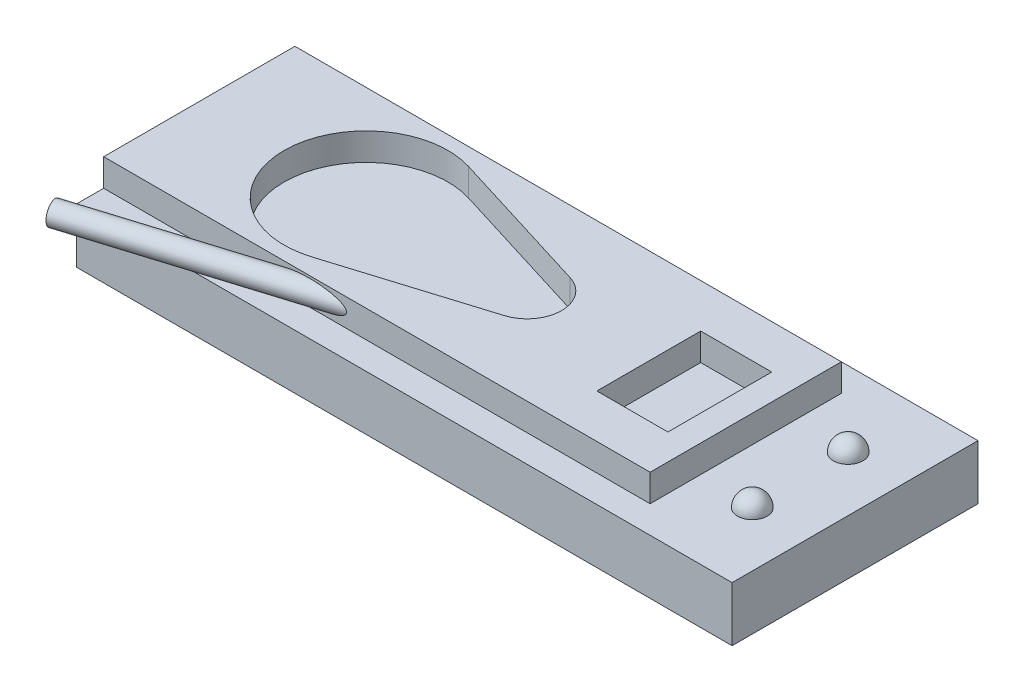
ISO-10303-21;
HEADER;
FILE_DESCRIPTION(('STEP AP214'),'2;1');
FILE_NAME('part.step','',(''),(''),'','','');
FILE_SCHEMA(('AUTOMOTIVE_DESIGN { 1 0 10303 214 1 1 1 1 }'));
ENDSEC;
DATA;
#1=APPLICATION_CONTEXT('core data for automotive mechanical design processes');
#2=APPLICATION_PROTOCOL_DEFINITION('international standard','automotive_design',2000,#1);
#3=PRODUCT_CONTEXT('',#1,'mechanical');
#4=PRODUCT('Part','Part','',(#3));
#5=PRODUCT_RELATED_PRODUCT_CATEGORY('part','',(#4));
#6=PRODUCT_DEFINITION_FORMATION('','',#4);
#7=PRODUCT_DEFINITION_CONTEXT('part definition',#1,'design');
#8=PRODUCT_DEFINITION('design','',#6,#7);
#9=PRODUCT_DEFINITION_SHAPE('','',#8);
#10=(LENGTH_UNIT() NAMED_UNIT(*) SI_UNIT(.MILLI.,.METRE.));
#11=(NAMED_UNIT(*) PLANE_ANGLE_UNIT() SI_UNIT($,.RADIAN.));
#12=(NAMED_UNIT(*) SI_UNIT($,.STERADIAN.) SOLID_ANGLE_UNIT());
#13=UNCERTAINTY_MEASURE_WITH_UNIT(LENGTH_MEASURE(1.E-05),#10,'distance_accuracy_value','');
#14=(GEOMETRIC_REPRESENTATION_CONTEXT(3) GLOBAL_UNCERTAINTY_ASSIGNED_CONTEXT((#13)) GLOBAL_UNIT_ASSIGNED_CONTEXT((#10,
#11,#12)) REPRESENTATION_CONTEXT('',''));
#15=CARTESIAN_POINT('',(0.,0.,0.));
#16=DIRECTION('',(0.,0.,1.));
#17=DIRECTION('',(1.,0.,0.));
#18=AXIS2_PLACEMENT_3D('',#15,#16,#17);
#19=CARTESIAN_POINT('',(0.,10.,0.));
#20=DIRECTION('',(0.,1.,0.));
#21=DIRECTION('',(0.,0.,1.));
#22=AXIS2_PLACEMENT_3D('',#19,#20,#21);
#23=PLANE('',#22);
#24=CARTESIAN_POINT('',(49.9740173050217,10.,8.77273485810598));
#25=DIRECTION('',(0.,1.,0.));
#26=DIRECTION('',(0.,0.,1.));
#27=AXIS2_PLACEMENT_3D('',#24,#25,#26);
#28=CIRCLE('',#27,2.70534052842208);
#29=CARTESIAN_POINT('',(49.9740173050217,10.,11.4780753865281));
#30=VERTEX_POINT('',#29);
#31=EDGE_CURVE('E335',#30,#30,#28,.F.);
#32=ORIENTED_EDGE('',*,*,#31,.T.);
#33=EDGE_LOOP('',(#32));
#34=FACE_BOUND('',#33,.T.);
#35=CARTESIAN_POINT('',(49.9740173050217,10.,-8.77273485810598));
#36=DIRECTION('',(0.,1.,0.));
#37=DIRECTION('',(0.,0.,1.));
#38=AXIS2_PLACEMENT_3D('',#35,#36,#37);
#39=CIRCLE('',#38,2.70534052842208);
#40=CARTESIAN_POINT('',(49.9740173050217,10.,-6.06739432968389));
#41=VERTEX_POINT('',#40);
#42=EDGE_CURVE('E194',#41,#41,#39,.F.);
#43=ORIENTED_EDGE('',*,*,#42,.T.);
#44=EDGE_LOOP('',(#43));
#45=FACE_BOUND('',#44,.T.);
#46=DIRECTION('',(0.,0.,1.));
#47=VECTOR('',#46,1.);
#48=CARTESIAN_POINT('',(-60.,10.,-22.5));
#49=LINE('',#48,#47);
#50=CARTESIAN_POINT('',(-60.,10.,-22.5));
#51=VERTEX_POINT('',#50);
#52=CARTESIAN_POINT('',(-60.,10.,-17.5));
#53=VERTEX_POINT('',#52);
#54=EDGE_CURVE('E301',#51,#53,#49,.T.);
#55=ORIENTED_EDGE('',*,*,#54,.T.);
#56=DIRECTION('',(1.,0.,0.));
#57=VECTOR('',#56,1.);
#58=CARTESIAN_POINT('',(-60.,10.,-17.5));
#59=LINE('',#58,#57);
#60=CARTESIAN_POINT('',(40.,10.,-17.5));
#61=VERTEX_POINT('',#60);
#62=EDGE_CURVE('E242',#53,#61,#59,.T.);
#63=ORIENTED_EDGE('',*,*,#62,.T.);
#64=DIRECTION('',(0.,0.,-1.));
#65=VECTOR('',#64,1.);
#66=CARTESIAN_POINT('',(40.,10.,17.5));
#67=LINE('',#66,#65);
#68=CARTESIAN_POINT('',(40.,10.,17.5));
#69=VERTEX_POINT('',#68);
#70=EDGE_CURVE('E269',#69,#61,#67,.T.);
#71=ORIENTED_EDGE('',*,*,#70,.F.);
#72=DIRECTION('',(1.,0.,0.));
#73=VECTOR('',#72,1.);
#74=CARTESIAN_POINT('',(-60.,10.,17.5));
#75=LINE('',#74,#73);
#76=CARTESIAN_POINT('',(-60.,10.,17.5));
#77=VERTEX_POINT('',#76);
#78=EDGE_CURVE('E256',#77,#69,#75,.T.);
#79=ORIENTED_EDGE('',*,*,#78,.F.);
#80=CARTESIAN_POINT('',(-60.,10.,22.5));
#81=VERTEX_POINT('',#80);
#82=EDGE_CURVE('E300',#77,#81,#49,.T.);
#83=ORIENTED_EDGE('',*,*,#82,.T.);
#84=DIRECTION('',(1.,0.,0.));
#85=VECTOR('',#84,1.);
#86=CARTESIAN_POINT('',(-60.,10.,22.5));
#87=LINE('',#86,#85);
#88=CARTESIAN_POINT('',(60.,10.,22.5));
#89=VERTEX_POINT('',#88);
#90=EDGE_CURVE('E304',#81,#89,#87,.T.);
#91=ORIENTED_EDGE('',*,*,#90,.T.);
#92=DIRECTION('',(0.,0.,-1.));
#93=VECTOR('',#92,1.);
#94=CARTESIAN_POINT('',(60.,10.,-22.5));
#95=LINE('',#94,#93);
#96=CARTESIAN_POINT('',(60.,10.,-22.5));
#97=VERTEX_POINT('',#96);
#98=EDGE_CURVE('E292',#89,#97,#95,.T.);
#99=ORIENTED_EDGE('',*,*,#98,.T.);
#100=DIRECTION('',(-1.,0.,0.));
#101=VECTOR('',#100,1.);
#102=CARTESIAN_POINT('',(-60.,10.,-22.5));
#103=LINE('',#102,#101);
#104=EDGE_CURVE('E296',#97,#51,#103,.T.);
#105=ORIENTED_EDGE('',*,*,#104,.T.);
#106=EDGE_LOOP('',(#55,#63,#71,#79,#83,#91,#99,#105));
#107=FACE_BOUND('',#106,.T.);
#108=ADVANCED_FACE('F41',(#34,#45,#107),#23,.T.);
#109=CARTESIAN_POINT('',(60.,10.,-22.5));
#110=DIRECTION('',(-1.,0.,0.));
#111=DIRECTION('',(0.,0.,1.));
#112=AXIS2_PLACEMENT_3D('',#109,#110,#111);
#113=PLANE('',#112);
#114=DIRECTION('',(0.,0.,-1.));
#115=VECTOR('',#114,1.);
#116=CARTESIAN_POINT('',(60.,0.,-22.5));
#117=LINE('',#116,#115);
#118=CARTESIAN_POINT('',(60.,0.,22.5));
#119=VERTEX_POINT('',#118);
#120=CARTESIAN_POINT('',(60.,0.,-22.5));
#121=VERTEX_POINT('',#120);
#122=EDGE_CURVE('E280',#119,#121,#117,.T.);
#123=ORIENTED_EDGE('',*,*,#122,.T.);
#124=DIRECTION('',(0.,-1.,0.));
#125=VECTOR('',#124,1.);
#126=CARTESIAN_POINT('',(60.,10.,-22.5));
#127=LINE('',#126,#125);
#128=EDGE_CURVE('E50',#97,#121,#127,.T.);
#129=ORIENTED_EDGE('',*,*,#128,.F.);
#130=ORIENTED_EDGE('',*,*,#98,.F.);
#131=DIRECTION('',(0.,-1.,0.));
#132=VECTOR('',#131,1.);
#133=CARTESIAN_POINT('',(60.,10.,22.5));
#134=LINE('',#133,#132);
#135=EDGE_CURVE('E307',#89,#119,#134,.T.);
#136=ORIENTED_EDGE('',*,*,#135,.T.);
#137=EDGE_LOOP('',(#123,#129,#130,#136));
#138=FACE_BOUND('',#137,.T.);
#139=ADVANCED_FACE('F43',(#138),#113,.F.);
#140=CARTESIAN_POINT('',(-60.,10.,-22.5));
#141=DIRECTION('',(0.,0.,1.));
#142=DIRECTION('',(1.,0.,0.));
#143=AXIS2_PLACEMENT_3D('',#140,#141,#142);
#144=PLANE('',#143);
#145=DIRECTION('',(-1.,0.,0.));
#146=VECTOR('',#145,1.);
#147=CARTESIAN_POINT('',(-60.,0.,-22.5));
#148=LINE('',#147,#146);
#149=CARTESIAN_POINT('',(-60.,0.,-22.5));
#150=VERTEX_POINT('',#149);
#151=EDGE_CURVE('E311',#121,#150,#148,.T.);
#152=ORIENTED_EDGE('',*,*,#151,.T.);
#153=DIRECTION('',(0.,-1.,0.));
#154=VECTOR('',#153,1.);
#155=CARTESIAN_POINT('',(-60.,10.,-22.5));
#156=LINE('',#155,#154);
#157=EDGE_CURVE('E326',#51,#150,#156,.T.);
#158=ORIENTED_EDGE('',*,*,#157,.F.);
#159=ORIENTED_EDGE('',*,*,#104,.F.);
#160=ORIENTED_EDGE('',*,*,#128,.T.);
#161=EDGE_LOOP('',(#152,#158,#159,#160));
#162=FACE_BOUND('',#161,.T.);
#163=ADVANCED_FACE('F386',(#162),#144,.F.);
#164=CARTESIAN_POINT('',(-60.,10.,-22.5));
#165=DIRECTION('',(1.,0.,0.));
#166=DIRECTION('',(0.,0.,-1.));
#167=AXIS2_PLACEMENT_3D('',#164,#165,#166);
#168=PLANE('',#167);
#169=DIRECTION('',(0.,0.,1.));
#170=VECTOR('',#169,1.);
#171=CARTESIAN_POINT('',(-60.,0.,-22.5));
#172=LINE('',#171,#170);
#173=CARTESIAN_POINT('',(-60.,0.,22.5));
#174=VERTEX_POINT('',#173);
#175=EDGE_CURVE('E314',#150,#174,#172,.T.);
#176=ORIENTED_EDGE('',*,*,#175,.T.);
#177=DIRECTION('',(0.,-1.,0.));
#178=VECTOR('',#177,1.);
#179=CARTESIAN_POINT('',(-60.,10.,22.5));
#180=LINE('',#179,#178);
#181=EDGE_CURVE('E322',#81,#174,#180,.T.);
#182=ORIENTED_EDGE('',*,*,#181,.F.);
#183=ORIENTED_EDGE('',*,*,#82,.F.);
#184=DIRECTION('',(0.,-1.,0.));
#185=VECTOR('',#184,1.);
#186=CARTESIAN_POINT('',(-60.,15.,17.5));
#187=LINE('',#186,#185);
#188=CARTESIAN_POINT('',(-60.,15.,17.5));
#189=VERTEX_POINT('',#188);
#190=EDGE_CURVE('E276',#189,#77,#187,.T.);
#191=ORIENTED_EDGE('',*,*,#190,.F.);
#192=DIRECTION('',(0.,0.,-1.));
#193=VECTOR('',#192,1.);
#194=CARTESIAN_POINT('',(-60.,15.,17.5));
#195=LINE('',#194,#193);
#196=CARTESIAN_POINT('',(-60.,15.,-17.5));
#197=VERTEX_POINT('',#196);
#198=EDGE_CURVE('E251',#189,#197,#195,.T.);
#199=ORIENTED_EDGE('',*,*,#198,.T.);
#200=DIRECTION('',(0.,-1.,0.));
#201=VECTOR('',#200,1.);
#202=CARTESIAN_POINT('',(-60.,15.,-17.5));
#203=LINE('',#202,#201);
#204=EDGE_CURVE('E266',#197,#53,#203,.T.);
#205=ORIENTED_EDGE('',*,*,#204,.T.);
#206=ORIENTED_EDGE('',*,*,#54,.F.);
#207=ORIENTED_EDGE('',*,*,#157,.T.);
#208=EDGE_LOOP('',(#176,#182,#183,#191,#199,#205,#206,#207));
#209=FACE_BOUND('',#208,.T.);
#210=ADVANCED_FACE('F371',(#209),#168,.F.);
#211=CARTESIAN_POINT('',(-60.,10.,22.5));
#212=DIRECTION('',(0.,0.,-1.));
#213=DIRECTION('',(-1.,0.,0.));
#214=AXIS2_PLACEMENT_3D('',#211,#212,#213);
#215=PLANE('',#214);
#216=DIRECTION('',(1.,0.,0.));
#217=VECTOR('',#216,1.);
#218=CARTESIAN_POINT('',(-60.,0.,22.5));
#219=LINE('',#218,#217);
#220=EDGE_CURVE('E297',#174,#119,#219,.T.);
#221=ORIENTED_EDGE('',*,*,#220,.T.);
#222=ORIENTED_EDGE('',*,*,#135,.F.);
#223=ORIENTED_EDGE('',*,*,#90,.F.);
#224=ORIENTED_EDGE('',*,*,#181,.T.);
#225=EDGE_LOOP('',(#221,#222,#223,#224));
#226=FACE_BOUND('',#225,.T.);
#227=ADVANCED_FACE('F381',(#226),#215,.F.);
#228=CARTESIAN_POINT('',(0.,0.,0.));
#229=DIRECTION('',(0.,1.,0.));
#230=DIRECTION('',(0.,0.,1.));
#231=AXIS2_PLACEMENT_3D('',#228,#229,#230);
#232=PLANE('',#231);
#233=ORIENTED_EDGE('',*,*,#122,.F.);
#234=ORIENTED_EDGE('',*,*,#220,.F.);
#235=ORIENTED_EDGE('',*,*,#175,.F.);
#236=ORIENTED_EDGE('',*,*,#151,.F.);
#237=EDGE_LOOP('',(#233,#234,#235,#236));
#238=FACE_BOUND('',#237,.T.);
#239=ADVANCED_FACE('F357',(#238),#232,.F.);
#240=CARTESIAN_POINT('',(-60.,15.,17.5));
#241=DIRECTION('',(0.,0.,-1.));
#242=DIRECTION('',(-1.,0.,0.));
#243=AXIS2_PLACEMENT_3D('',#240,#241,#242);
#244=PLANE('',#243);
#245=CARTESIAN_POINT('',(-22.3274598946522,12.5778105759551,17.5));
#246=DIRECTION('',(0.,0.,-1.));
#247=DIRECTION('',(1.,0.,0.));
#248=AXIS2_PLACEMENT_3D('',#245,#246,#247);
#249=ELLIPSE('',#248,6.77349939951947,2.);
#250=CARTESIAN_POINT('',(-15.5539604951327,12.5778105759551,17.5));
#251=VERTEX_POINT('',#250);
#252=EDGE_CURVE('E11',#251,#251,#249,.F.);
#253=ORIENTED_EDGE('',*,*,#252,.F.);
#254=EDGE_LOOP('',(#253));
#255=FACE_BOUND('',#254,.T.);
#256=ORIENTED_EDGE('',*,*,#78,.T.);
#257=DIRECTION('',(0.,-1.,0.));
#258=VECTOR('',#257,1.);
#259=CARTESIAN_POINT('',(40.,15.,17.5));
#260=LINE('',#259,#258);
#261=CARTESIAN_POINT('',(40.,15.,17.5));
#262=VERTEX_POINT('',#261);
#263=EDGE_CURVE('E281',#262,#69,#260,.T.);
#264=ORIENTED_EDGE('',*,*,#263,.F.);
#265=DIRECTION('',(1.,0.,0.));
#266=VECTOR('',#265,1.);
#267=CARTESIAN_POINT('',(-60.,15.,17.5));
#268=LINE('',#267,#266);
#269=EDGE_CURVE('E263',#189,#262,#268,.T.);
#270=ORIENTED_EDGE('',*,*,#269,.F.);
#271=ORIENTED_EDGE('',*,*,#190,.T.);
#272=EDGE_LOOP('',(#256,#264,#270,#271));
#273=FACE_BOUND('',#272,.T.);
#274=ADVANCED_FACE('F353',(#255,#273),#244,.F.);
#275=CARTESIAN_POINT('',(40.,15.,17.5));
#276=DIRECTION('',(-1.,0.,0.));
#277=DIRECTION('',(0.,0.,1.));
#278=AXIS2_PLACEMENT_3D('',#275,#276,#277);
#279=PLANE('',#278);
#280=ORIENTED_EDGE('',*,*,#70,.T.);
#281=DIRECTION('',(0.,-1.,0.));
#282=VECTOR('',#281,1.);
#283=CARTESIAN_POINT('',(40.,15.,-17.5));
#284=LINE('',#283,#282);
#285=CARTESIAN_POINT('',(40.,15.,-17.5));
#286=VERTEX_POINT('',#285);
#287=EDGE_CURVE('E285',#286,#61,#284,.T.);
#288=ORIENTED_EDGE('',*,*,#287,.F.);
#289=DIRECTION('',(0.,0.,-1.));
#290=VECTOR('',#289,1.);
#291=CARTESIAN_POINT('',(40.,15.,17.5));
#292=LINE('',#291,#290);
#293=EDGE_CURVE('E260',#262,#286,#292,.T.);
#294=ORIENTED_EDGE('',*,*,#293,.F.);
#295=ORIENTED_EDGE('',*,*,#263,.T.);
#296=EDGE_LOOP('',(#280,#288,#294,#295));
#297=FACE_BOUND('',#296,.T.);
#298=ADVANCED_FACE('F356',(#297),#279,.F.);
#299=CARTESIAN_POINT('',(-60.,15.,-17.5));
#300=DIRECTION('',(0.,0.,-1.));
#301=DIRECTION('',(-1.,0.,0.));
#302=AXIS2_PLACEMENT_3D('',#299,#300,#301);
#303=PLANE('',#302);
#304=ORIENTED_EDGE('',*,*,#62,.F.);
#305=ORIENTED_EDGE('',*,*,#204,.F.);
#306=DIRECTION('',(1.,0.,0.));
#307=VECTOR('',#306,1.);
#308=CARTESIAN_POINT('',(-60.,15.,-17.5));
#309=LINE('',#308,#307);
#310=EDGE_CURVE('E255',#197,#286,#309,.T.);
#311=ORIENTED_EDGE('',*,*,#310,.T.);
#312=ORIENTED_EDGE('',*,*,#287,.T.);
#313=EDGE_LOOP('',(#304,#305,#311,#312));
#314=FACE_BOUND('',#313,.T.);
#315=ADVANCED_FACE('F403',(#314),#303,.T.);
#316=CARTESIAN_POINT('',(0.,15.,0.));
#317=DIRECTION('',(0.,-1.,0.));
#318=DIRECTION('',(0.,0.,-1.));
#319=AXIS2_PLACEMENT_3D('',#316,#317,#318);
#320=PLANE('',#319);
#321=DIRECTION('',(-1.,0.,0.));
#322=VECTOR('',#321,1.);
#323=CARTESIAN_POINT('',(22.2556339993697,15.,-9.5));
#324=LINE('',#323,#322);
#325=CARTESIAN_POINT('',(35.2556339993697,15.,-9.5));
#326=VERTEX_POINT('',#325);
#327=CARTESIAN_POINT('',(22.2556339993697,15.,-9.5));
#328=VERTEX_POINT('',#327);
#329=EDGE_CURVE('E193',#326,#328,#324,.T.);
#330=ORIENTED_EDGE('',*,*,#329,.F.);
#331=DIRECTION('',(0.,0.,-1.));
#332=VECTOR('',#331,1.);
#333=CARTESIAN_POINT('',(35.2556339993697,15.,9.5));
#334=LINE('',#333,#332);
#335=CARTESIAN_POINT('',(35.2556339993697,15.,9.5));
#336=VERTEX_POINT('',#335);
#337=EDGE_CURVE('E57',#336,#326,#334,.T.);
#338=ORIENTED_EDGE('',*,*,#337,.F.);
#339=DIRECTION('',(1.,0.,0.));
#340=VECTOR('',#339,1.);
#341=CARTESIAN_POINT('',(22.2556339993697,15.,9.5));
#342=LINE('',#341,#340);
#343=CARTESIAN_POINT('',(22.2556339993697,15.,9.5));
#344=VERTEX_POINT('',#343);
#345=EDGE_CURVE('E178',#344,#336,#342,.T.);
#346=ORIENTED_EDGE('',*,*,#345,.F.);
#347=DIRECTION('',(0.,0.,1.));
#348=VECTOR('',#347,1.);
#349=CARTESIAN_POINT('',(22.2556339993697,15.,9.5));
#350=LINE('',#349,#348);
#351=EDGE_CURVE('E182',#328,#344,#350,.T.);
#352=ORIENTED_EDGE('',*,*,#351,.F.);
#353=EDGE_LOOP('',(#330,#338,#346,#352));
#354=FACE_BOUND('',#353,.T.);
#355=DIRECTION('',(-0.955414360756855,0.,-0.295268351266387));
#356=VECTOR('',#355,1.);
#357=CARTESIAN_POINT('',(1.85853636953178,15.,-6.01375775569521));
#358=LINE('',#357,#356);
#359=CARTESIAN_POINT('',(1.85853636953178,15.,-6.01375775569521));
#360=VERTEX_POINT('',#359);
#361=CARTESIAN_POINT('',(-25.0546714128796,15.,-14.3312154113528));
#362=VERTEX_POINT('',#361);
#363=EDGE_CURVE('E228',#360,#362,#358,.T.);
#364=ORIENTED_EDGE('',*,*,#363,.F.);
#365=CARTESIAN_POINT('',(0.,15.,0.));
#366=DIRECTION('',(0.,1.,0.));
#367=DIRECTION('',(0.,0.,1.));
#368=AXIS2_PLACEMENT_3D('',#365,#366,#367);
#369=CIRCLE('',#368,6.29439749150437);
#370=CARTESIAN_POINT('',(1.8585363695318,15.,6.01375775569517));
#371=VERTEX_POINT('',#370);
#372=EDGE_CURVE('E65',#371,#360,#369,.T.);
#373=ORIENTED_EDGE('',*,*,#372,.F.);
#374=DIRECTION('',(0.955414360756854,0.,-0.29526835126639));
#375=VECTOR('',#374,1.);
#376=CARTESIAN_POINT('',(1.8585363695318,15.,6.01375775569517));
#377=LINE('',#376,#375);
#378=CARTESIAN_POINT('',(-25.0546714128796,15.,14.3312154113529));
#379=VERTEX_POINT('',#378);
#380=EDGE_CURVE('E213',#379,#371,#377,.T.);
#381=ORIENTED_EDGE('',*,*,#380,.F.);
#382=CARTESIAN_POINT('',(-29.4836966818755,15.,0.));
#383=DIRECTION('',(0.,1.,0.));
#384=DIRECTION('',(0.,0.,1.));
#385=AXIS2_PLACEMENT_3D('',#382,#383,#384);
#386=CIRCLE('',#385,15.);
#387=EDGE_CURVE('E232',#362,#379,#386,.T.);
#388=ORIENTED_EDGE('',*,*,#387,.F.);
#389=EDGE_LOOP('',(#364,#373,#381,#388));
#390=FACE_BOUND('',#389,.T.);
#391=ORIENTED_EDGE('',*,*,#198,.F.);
#392=ORIENTED_EDGE('',*,*,#269,.T.);
#393=ORIENTED_EDGE('',*,*,#293,.T.);
#394=ORIENTED_EDGE('',*,*,#310,.F.);
#395=EDGE_LOOP('',(#391,#392,#393,#394));
#396=FACE_BOUND('',#395,.T.);
#397=ADVANCED_FACE('F369',(#354,#390,#396),#320,.F.);
#398=CARTESIAN_POINT('',(0.,10.,0.));
#399=DIRECTION('',(0.,1.,0.));
#400=DIRECTION('',(0.,0.,1.));
#401=AXIS2_PLACEMENT_3D('',#398,#399,#400);
#402=CYLINDRICAL_SURFACE('',#401,6.29439749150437);
#403=ORIENTED_EDGE('',*,*,#372,.T.);
#404=DIRECTION('',(0.,1.,0.));
#405=VECTOR('',#404,1.);
#406=CARTESIAN_POINT('',(1.85853636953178,10.,-6.01375775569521));
#407=LINE('',#406,#405);
#408=CARTESIAN_POINT('',(1.85853636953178,10.,-6.01375775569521));
#409=VERTEX_POINT('',#408);
#410=EDGE_CURVE('E225',#409,#360,#407,.T.);
#411=ORIENTED_EDGE('',*,*,#410,.F.);
#412=CARTESIAN_POINT('',(0.,10.,0.));
#413=DIRECTION('',(0.,1.,0.));
#414=DIRECTION('',(0.,0.,1.));
#415=AXIS2_PLACEMENT_3D('',#412,#413,#414);
#416=CIRCLE('',#415,6.29439749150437);
#417=CARTESIAN_POINT('',(1.8585363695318,10.,6.01375775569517));
#418=VERTEX_POINT('',#417);
#419=EDGE_CURVE('E208',#418,#409,#416,.T.);
#420=ORIENTED_EDGE('',*,*,#419,.F.);
#421=DIRECTION('',(0.,1.,0.));
#422=VECTOR('',#421,1.);
#423=CARTESIAN_POINT('',(1.8585363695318,10.,6.01375775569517));
#424=LINE('',#423,#422);
#425=EDGE_CURVE('E239',#418,#371,#424,.T.);
#426=ORIENTED_EDGE('',*,*,#425,.T.);
#427=EDGE_LOOP('',(#403,#411,#420,#426));
#428=FACE_BOUND('',#427,.T.);
#429=ADVANCED_FACE('F411',(#428),#402,.F.);
#430=CARTESIAN_POINT('',(1.8585363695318,10.,6.01375775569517));
#431=DIRECTION('',(0.29526835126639,0.,0.955414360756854));
#432=DIRECTION('',(0.955414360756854,0.,-0.29526835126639));
#433=AXIS2_PLACEMENT_3D('',#430,#431,#432);
#434=PLANE('',#433);
#435=ORIENTED_EDGE('',*,*,#380,.T.);
#436=ORIENTED_EDGE('',*,*,#425,.F.);
#437=DIRECTION('',(0.955414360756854,0.,-0.29526835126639));
#438=VECTOR('',#437,1.);
#439=CARTESIAN_POINT('',(1.8585363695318,10.,6.01375775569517));
#440=LINE('',#439,#438);
#441=CARTESIAN_POINT('',(-25.0546714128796,10.,14.3312154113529));
#442=VERTEX_POINT('',#441);
#443=EDGE_CURVE('E221',#442,#418,#440,.T.);
#444=ORIENTED_EDGE('',*,*,#443,.F.);
#445=DIRECTION('',(0.,1.,0.));
#446=VECTOR('',#445,1.);
#447=CARTESIAN_POINT('',(-25.0546714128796,10.,14.3312154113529));
#448=LINE('',#447,#446);
#449=EDGE_CURVE('E243',#442,#379,#448,.T.);
#450=ORIENTED_EDGE('',*,*,#449,.T.);
#451=EDGE_LOOP('',(#435,#436,#444,#450));
#452=FACE_BOUND('',#451,.T.);
#453=ADVANCED_FACE('F415',(#452),#434,.F.);
#454=CARTESIAN_POINT('',(-29.4836966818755,10.,0.));
#455=DIRECTION('',(0.,1.,0.));
#456=DIRECTION('',(0.,0.,1.));
#457=AXIS2_PLACEMENT_3D('',#454,#455,#456);
#458=CYLINDRICAL_SURFACE('',#457,15.);
#459=ORIENTED_EDGE('',*,*,#387,.T.);
#460=ORIENTED_EDGE('',*,*,#449,.F.);
#461=CARTESIAN_POINT('',(-29.4836966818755,10.,0.));
#462=DIRECTION('',(0.,1.,0.));
#463=DIRECTION('',(0.,0.,1.));
#464=AXIS2_PLACEMENT_3D('',#461,#462,#463);
#465=CIRCLE('',#464,15.);
#466=CARTESIAN_POINT('',(-25.0546714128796,10.,-14.3312154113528));
#467=VERTEX_POINT('',#466);
#468=EDGE_CURVE('E217',#467,#442,#465,.T.);
#469=ORIENTED_EDGE('',*,*,#468,.F.);
#470=DIRECTION('',(0.,1.,0.));
#471=VECTOR('',#470,1.);
#472=CARTESIAN_POINT('',(-25.0546714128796,10.,-14.3312154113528));
#473=LINE('',#472,#471);
#474=EDGE_CURVE('E246',#467,#362,#473,.T.);
#475=ORIENTED_EDGE('',*,*,#474,.T.);
#476=EDGE_LOOP('',(#459,#460,#469,#475));
#477=FACE_BOUND('',#476,.T.);
#478=ADVANCED_FACE('F420',(#477),#458,.F.);
#479=CARTESIAN_POINT('',(1.85853636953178,10.,-6.01375775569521));
#480=DIRECTION('',(0.295268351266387,0.,-0.955414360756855));
#481=DIRECTION('',(-0.955414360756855,0.,-0.295268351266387));
#482=AXIS2_PLACEMENT_3D('',#479,#480,#481);
#483=PLANE('',#482);
#484=ORIENTED_EDGE('',*,*,#363,.T.);
#485=ORIENTED_EDGE('',*,*,#474,.F.);
#486=DIRECTION('',(-0.955414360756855,0.,-0.295268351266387));
#487=VECTOR('',#486,1.);
#488=CARTESIAN_POINT('',(1.85853636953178,10.,-6.01375775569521));
#489=LINE('',#488,#487);
#490=EDGE_CURVE('E212',#409,#467,#489,.T.);
#491=ORIENTED_EDGE('',*,*,#490,.F.);
#492=ORIENTED_EDGE('',*,*,#410,.T.);
#493=EDGE_LOOP('',(#484,#485,#491,#492));
#494=FACE_BOUND('',#493,.T.);
#495=ADVANCED_FACE('F416',(#494),#483,.F.);
#496=CARTESIAN_POINT('',(0.,10.,0.));
#497=DIRECTION('',(0.,1.,0.));
#498=DIRECTION('',(0.,0.,1.));
#499=AXIS2_PLACEMENT_3D('',#496,#497,#498);
#500=PLANE('',#499);
#501=ORIENTED_EDGE('',*,*,#419,.T.);
#502=ORIENTED_EDGE('',*,*,#490,.T.);
#503=ORIENTED_EDGE('',*,*,#468,.T.);
#504=ORIENTED_EDGE('',*,*,#443,.T.);
#505=EDGE_LOOP('',(#501,#502,#503,#504));
#506=FACE_BOUND('',#505,.T.);
#507=ADVANCED_FACE('F419',(#506),#500,.T.);
#508=CARTESIAN_POINT('',(35.2556339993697,10.,9.5));
#509=DIRECTION('',(1.,0.,0.));
#510=DIRECTION('',(0.,0.,-1.));
#511=AXIS2_PLACEMENT_3D('',#508,#509,#510);
#512=PLANE('',#511);
#513=ORIENTED_EDGE('',*,*,#337,.T.);
#514=DIRECTION('',(0.,1.,0.));
#515=VECTOR('',#514,1.);
#516=CARTESIAN_POINT('',(35.2556339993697,10.,-9.5));
#517=LINE('',#516,#515);
#518=CARTESIAN_POINT('',(35.2556339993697,10.,-9.5));
#519=VERTEX_POINT('',#518);
#520=EDGE_CURVE('E153',#519,#326,#517,.T.);
#521=ORIENTED_EDGE('',*,*,#520,.F.);
#522=DIRECTION('',(0.,0.,-1.));
#523=VECTOR('',#522,1.);
#524=CARTESIAN_POINT('',(35.2556339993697,10.,9.5));
#525=LINE('',#524,#523);
#526=CARTESIAN_POINT('',(35.2556339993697,10.,9.5));
#527=VERTEX_POINT('',#526);
#528=EDGE_CURVE('E157',#527,#519,#525,.T.);
#529=ORIENTED_EDGE('',*,*,#528,.F.);
#530=DIRECTION('',(0.,1.,0.));
#531=VECTOR('',#530,1.);
#532=CARTESIAN_POINT('',(35.2556339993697,10.,9.5));
#533=LINE('',#532,#531);
#534=EDGE_CURVE('E200',#527,#336,#533,.T.);
#535=ORIENTED_EDGE('',*,*,#534,.T.);
#536=EDGE_LOOP('',(#513,#521,#529,#535));
#537=FACE_BOUND('',#536,.T.);
#538=ADVANCED_FACE('F155',(#537),#512,.F.);
#539=CARTESIAN_POINT('',(22.2556339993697,10.,9.5));
#540=DIRECTION('',(0.,0.,1.));
#541=DIRECTION('',(1.,0.,0.));
#542=AXIS2_PLACEMENT_3D('',#539,#540,#541);
#543=PLANE('',#542);
#544=ORIENTED_EDGE('',*,*,#345,.T.);
#545=ORIENTED_EDGE('',*,*,#534,.F.);
#546=DIRECTION('',(1.,0.,0.));
#547=VECTOR('',#546,1.);
#548=CARTESIAN_POINT('',(22.2556339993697,10.,9.5));
#549=LINE('',#548,#547);
#550=CARTESIAN_POINT('',(22.2556339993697,10.,9.5));
#551=VERTEX_POINT('',#550);
#552=EDGE_CURVE('E164',#551,#527,#549,.T.);
#553=ORIENTED_EDGE('',*,*,#552,.F.);
#554=DIRECTION('',(0.,1.,0.));
#555=VECTOR('',#554,1.);
#556=CARTESIAN_POINT('',(22.2556339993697,10.,9.5));
#557=LINE('',#556,#555);
#558=EDGE_CURVE('E203',#551,#344,#557,.T.);
#559=ORIENTED_EDGE('',*,*,#558,.T.);
#560=EDGE_LOOP('',(#544,#545,#553,#559));
#561=FACE_BOUND('',#560,.T.);
#562=ADVANCED_FACE('F433',(#561),#543,.F.);
#563=CARTESIAN_POINT('',(22.2556339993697,10.,9.5));
#564=DIRECTION('',(-1.,0.,0.));
#565=DIRECTION('',(0.,0.,1.));
#566=AXIS2_PLACEMENT_3D('',#563,#564,#565);
#567=PLANE('',#566);
#568=ORIENTED_EDGE('',*,*,#351,.T.);
#569=ORIENTED_EDGE('',*,*,#558,.F.);
#570=DIRECTION('',(0.,0.,1.));
#571=VECTOR('',#570,1.);
#572=CARTESIAN_POINT('',(22.2556339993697,10.,9.5));
#573=LINE('',#572,#571);
#574=CARTESIAN_POINT('',(22.2556339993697,10.,-9.5));
#575=VERTEX_POINT('',#574);
#576=EDGE_CURVE('E173',#575,#551,#573,.T.);
#577=ORIENTED_EDGE('',*,*,#576,.F.);
#578=DIRECTION('',(0.,1.,0.));
#579=VECTOR('',#578,1.);
#580=CARTESIAN_POINT('',(22.2556339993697,10.,-9.5));
#581=LINE('',#580,#579);
#582=EDGE_CURVE('E163',#575,#328,#581,.T.);
#583=ORIENTED_EDGE('',*,*,#582,.T.);
#584=EDGE_LOOP('',(#568,#569,#577,#583));
#585=FACE_BOUND('',#584,.T.);
#586=ADVANCED_FACE('F436',(#585),#567,.F.);
#587=CARTESIAN_POINT('',(22.2556339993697,10.,-9.5));
#588=DIRECTION('',(0.,0.,-1.));
#589=DIRECTION('',(-1.,0.,0.));
#590=AXIS2_PLACEMENT_3D('',#587,#588,#589);
#591=PLANE('',#590);
#592=ORIENTED_EDGE('',*,*,#329,.T.);
#593=ORIENTED_EDGE('',*,*,#582,.F.);
#594=DIRECTION('',(-1.,0.,0.));
#595=VECTOR('',#594,1.);
#596=CARTESIAN_POINT('',(22.2556339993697,10.,-9.5));
#597=LINE('',#596,#595);
#598=EDGE_CURVE('E167',#519,#575,#597,.T.);
#599=ORIENTED_EDGE('',*,*,#598,.F.);
#600=ORIENTED_EDGE('',*,*,#520,.T.);
#601=EDGE_LOOP('',(#592,#593,#599,#600));
#602=FACE_BOUND('',#601,.T.);
#603=ADVANCED_FACE('F168',(#602),#591,.F.);
#604=CARTESIAN_POINT('',(0.,10.,0.));
#605=DIRECTION('',(0.,-1.,0.));
#606=DIRECTION('',(0.,0.,-1.));
#607=AXIS2_PLACEMENT_3D('',#604,#605,#606);
#608=PLANE('',#607);
#609=ORIENTED_EDGE('',*,*,#528,.T.);
#610=ORIENTED_EDGE('',*,*,#598,.T.);
#611=ORIENTED_EDGE('',*,*,#576,.T.);
#612=ORIENTED_EDGE('',*,*,#552,.T.);
#613=EDGE_LOOP('',(#609,#610,#611,#612));
#614=FACE_BOUND('',#613,.T.);
#615=ADVANCED_FACE('F175',(#614),#608,.F.);
#616=CARTESIAN_POINT('',(49.9740173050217,10.,-8.77273485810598));
#617=DIRECTION('',(-1.,0.,0.));
#618=DIRECTION('',(0.,0.,1.));
#619=AXIS2_PLACEMENT_3D('',#616,#617,#618);
#620=SPHERICAL_SURFACE('',#619,2.70534052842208);
#621=CARTESIAN_POINT('',(49.9740173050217,10.,-8.77273485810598));
#622=DIRECTION('',(0.,1.,0.));
#623=DIRECTION('',(0.,0.,1.));
#624=AXIS2_PLACEMENT_3D('',#621,#622,#623);
#625=SPHERICAL_SURFACE('',#624,2.70534052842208);
#626=ORIENTED_EDGE('',*,*,#42,.F.);
#627=EDGE_LOOP('',(#626));
#628=FACE_BOUND('',#627,.T.);
#629=ADVANCED_FACE('F445',(#628),#625,.T.);
#630=CARTESIAN_POINT('',(49.9740173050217,10.,8.77273485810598));
#631=DIRECTION('',(-1.,0.,0.));
#632=DIRECTION('',(0.,0.,-1.));
#633=AXIS2_PLACEMENT_3D('',#630,#631,#632);
#634=SPHERICAL_SURFACE('',#633,2.70534052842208);
#635=CARTESIAN_POINT('',(49.9740173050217,10.,8.77273485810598));
#636=DIRECTION('',(0.,1.,0.));
#637=DIRECTION('',(0.,0.,1.));
#638=AXIS2_PLACEMENT_3D('',#635,#636,#637);
#639=SPHERICAL_SURFACE('',#638,2.70534052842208);
#640=ORIENTED_EDGE('',*,*,#31,.F.);
#641=EDGE_LOOP('',(#640));
#642=FACE_BOUND('',#641,.T.);
#643=ADVANCED_FACE('F349',(#642),#639,.T.);
#644=CARTESIAN_POINT('',(-58.1562895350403,12.5778105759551,28.5728076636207));
#645=DIRECTION('',(0.955414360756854,0.,-0.29526835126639));
#646=DIRECTION('',(-0.29526835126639,0.,-0.955414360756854));
#647=AXIS2_PLACEMENT_3D('',#644,#645,#646);
#648=CYLINDRICAL_SURFACE('',#647,2.);
#649=CARTESIAN_POINT('',(-58.1562895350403,12.5778105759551,28.5728076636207));
#650=DIRECTION('',(-0.955414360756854,0.,0.29526835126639));
#651=DIRECTION('',(0.29526835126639,0.,0.955414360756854));
#652=AXIS2_PLACEMENT_3D('',#649,#650,#651);
#653=CIRCLE('',#652,2.);
#654=CARTESIAN_POINT('',(-57.5657528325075,12.5778105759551,30.4836363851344));
#655=VERTEX_POINT('',#654);
#656=EDGE_CURVE('E185',#655,#655,#653,.T.);
#657=ORIENTED_EDGE('',*,*,#656,.F.);
#658=EDGE_LOOP('',(#657));
#659=FACE_BOUND('',#658,.T.);
#660=ORIENTED_EDGE('',*,*,#252,.T.);
#661=EDGE_LOOP('',(#660));
#662=FACE_BOUND('',#661,.T.);
#663=ADVANCED_FACE('F346',(#659,#662),#648,.T.);
#664=CARTESIAN_POINT('',(-58.1562895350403,12.5778105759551,28.5728076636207));
#665=DIRECTION('',(-0.955414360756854,0.,0.29526835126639));
#666=DIRECTION('',(0.29526835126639,0.,0.955414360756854));
#667=AXIS2_PLACEMENT_3D('',#664,#665,#666);
#668=PLANE('',#667);
#669=ORIENTED_EDGE('',*,*,#656,.T.);
#670=EDGE_LOOP('',(#669));
#671=FACE_BOUND('',#670,.T.);
#672=ADVANCED_FACE('F344',(#671),#668,.T.);
#673=CLOSED_SHELL('',(#108,#139,#163,#210,#227,#239,#274,#298,#315,#397,#429,#453,#478,#495,
#507,#538,#562,#586,#603,#615,#629,#643,#663,#672));
#674=MANIFOLD_SOLID_BREP('B2',#673);
#675=ADVANCED_BREP_SHAPE_REPRESENTATION('',(#18,#674),#14);
#676=SHAPE_DEFINITION_REPRESENTATION(#9,#675);
ENDSEC;
END-ISO-10303-21;
